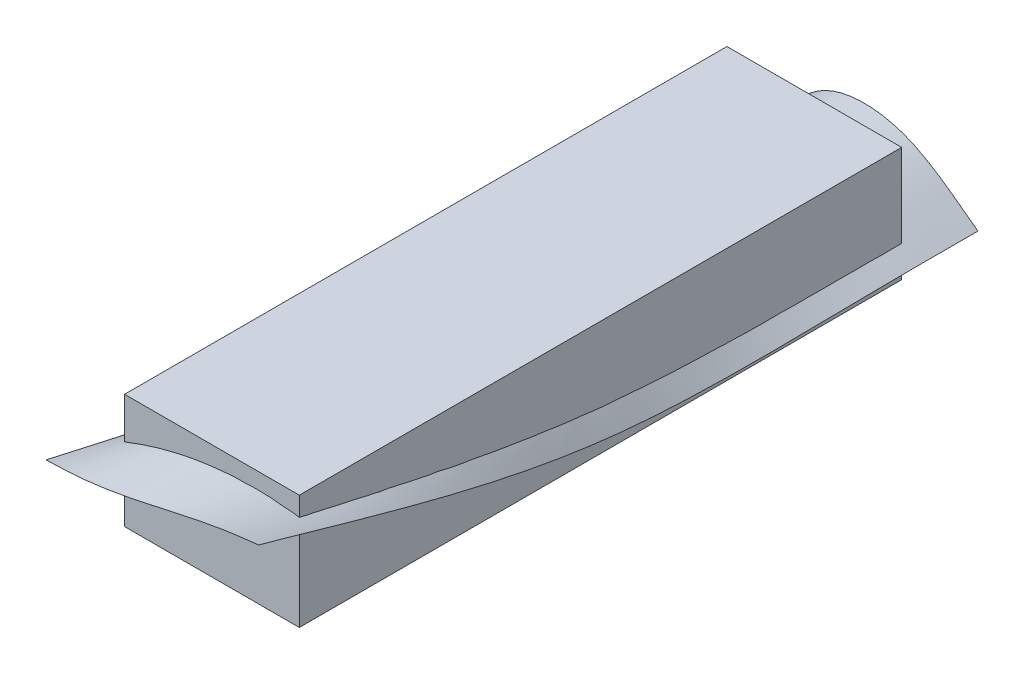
ISO-10303-21;
HEADER;
FILE_DESCRIPTION(('STEP AP214'),'2;1');
FILE_NAME('part.step','',(''),(''),'','','');
FILE_SCHEMA(('AUTOMOTIVE_DESIGN { 1 0 10303 214 1 1 1 1 }'));
ENDSEC;
DATA;
#1=APPLICATION_CONTEXT('core data for automotive mechanical design processes');
#2=APPLICATION_PROTOCOL_DEFINITION('international standard','automotive_design',2000,#1);
#3=PRODUCT_CONTEXT('',#1,'mechanical');
#4=PRODUCT('Part','Part','',(#3));
#5=PRODUCT_RELATED_PRODUCT_CATEGORY('part','',(#4));
#6=PRODUCT_DEFINITION_FORMATION('','',#4);
#7=PRODUCT_DEFINITION_CONTEXT('part definition',#1,'design');
#8=PRODUCT_DEFINITION('design','',#6,#7);
#9=PRODUCT_DEFINITION_SHAPE('','',#8);
#10=(LENGTH_UNIT() NAMED_UNIT(*) SI_UNIT(.MILLI.,.METRE.));
#11=(NAMED_UNIT(*) PLANE_ANGLE_UNIT() SI_UNIT($,.RADIAN.));
#12=(NAMED_UNIT(*) SI_UNIT($,.STERADIAN.) SOLID_ANGLE_UNIT());
#13=UNCERTAINTY_MEASURE_WITH_UNIT(LENGTH_MEASURE(1.E-05),#10,'distance_accuracy_value','');
#14=(GEOMETRIC_REPRESENTATION_CONTEXT(3) GLOBAL_UNCERTAINTY_ASSIGNED_CONTEXT((#13)) GLOBAL_UNIT_ASSIGNED_CONTEXT((#10,
#11,#12)) REPRESENTATION_CONTEXT('',''));
#15=CARTESIAN_POINT('',(0.,0.,0.));
#16=DIRECTION('',(0.,0.,1.));
#17=DIRECTION('',(1.,0.,0.));
#18=AXIS2_PLACEMENT_3D('',#15,#16,#17);
#19=CARTESIAN_POINT('',(101.832993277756,58.3264522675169,347.699662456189));
#20=CARTESIAN_POINT('',(101.574945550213,55.1696757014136,337.209774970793));
#21=CARTESIAN_POINT('',(101.31689782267,52.0128991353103,326.719887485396));
#22=CARTESIAN_POINT('',(101.058850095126,48.8561225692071,316.23));
#23=CARTESIAN_POINT('',(99.768943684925,33.0763039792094,263.794067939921));
#24=CARTESIAN_POINT('',(97.1884664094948,1.50853831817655,158.895193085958));
#25=CARTESIAN_POINT('',(100.105042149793,10.4608383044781,52.853665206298));
#26=CARTESIAN_POINT('',(100.105042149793,10.4608383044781,0.));
#27=CARTESIAN_POINT('',(100.105042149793,10.4608383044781,-10.5680118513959));
#28=CARTESIAN_POINT('',(100.105042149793,10.4608383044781,-21.1360237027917));
#29=CARTESIAN_POINT('',(100.105042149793,10.4608383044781,-31.7040355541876));
#30=CARTESIAN_POINT('',(98.4680638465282,57.9272116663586,347.701012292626));
#31=CARTESIAN_POINT('',(98.2960320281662,55.0403146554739,337.210674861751));
#32=CARTESIAN_POINT('',(98.1240002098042,52.1534176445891,326.720337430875));
#33=CARTESIAN_POINT('',(97.9519683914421,49.2665206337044,316.23));
#34=CARTESIAN_POINT('',(97.0920307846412,34.8357523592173,263.791818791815));
#35=CARTESIAN_POINT('',(95.371712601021,5.96678225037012,158.888444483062));
#36=CARTESIAN_POINT('',(97.3160964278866,12.5084829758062,52.8694208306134));
#37=CARTESIAN_POINT('',(97.3160964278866,12.5084829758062,0.));
#38=CARTESIAN_POINT('',(97.3160964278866,12.5084829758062,-10.571162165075));
#39=CARTESIAN_POINT('',(97.3160964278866,12.5084829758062,-21.14232433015));
#40=CARTESIAN_POINT('',(97.3160964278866,12.5084829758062,-31.713486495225));
#41=CARTESIAN_POINT('',(95.1031344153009,57.5279710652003,347.702362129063));
#42=CARTESIAN_POINT('',(95.0171185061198,54.9109536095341,337.211574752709));
#43=CARTESIAN_POINT('',(94.9311025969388,52.293936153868,326.720787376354));
#44=CARTESIAN_POINT('',(94.8450866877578,49.6769186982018,316.23));
#45=CARTESIAN_POINT('',(94.4151178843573,36.5952007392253,263.78956964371));
#46=CARTESIAN_POINT('',(93.5549587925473,10.4250261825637,158.881695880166));
#47=CARTESIAN_POINT('',(94.52715070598,14.5561276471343,52.8851764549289));
#48=CARTESIAN_POINT('',(94.52715070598,14.5561276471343,0.));
#49=CARTESIAN_POINT('',(94.52715070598,14.5561276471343,-10.5743124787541));
#50=CARTESIAN_POINT('',(94.52715070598,14.5561276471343,-21.1486249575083));
#51=CARTESIAN_POINT('',(94.52715070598,14.5561276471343,-31.7229374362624));
#52=CARTESIAN_POINT('',(91.7382049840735,57.128730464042,347.7037119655));
#53=CARTESIAN_POINT('',(91.7382049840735,54.7815925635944,337.212474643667));
#54=CARTESIAN_POINT('',(91.7382049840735,52.4344546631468,326.721237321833));
#55=CARTESIAN_POINT('',(91.7382049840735,50.0873167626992,316.23));
#56=CARTESIAN_POINT('',(91.7382049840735,38.3546491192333,263.787320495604));
#57=CARTESIAN_POINT('',(91.7382049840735,14.8832701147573,158.874947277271));
#58=CARTESIAN_POINT('',(91.7382049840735,16.6037723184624,52.9009320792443));
#59=CARTESIAN_POINT('',(91.7382049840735,16.6037723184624,0.));
#60=CARTESIAN_POINT('',(91.7382049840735,16.6037723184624,-10.5774627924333));
#61=CARTESIAN_POINT('',(91.7382049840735,16.6037723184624,-21.1549255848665));
#62=CARTESIAN_POINT('',(91.7382049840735,16.6037723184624,-31.7323883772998));
#63=CARTESIAN_POINT('',(78.9559110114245,55.6121427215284,347.708839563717));
#64=CARTESIAN_POINT('',(79.2826580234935,54.2901911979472,337.215893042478));
#65=CARTESIAN_POINT('',(79.6094050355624,52.9682396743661,326.722946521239));
#66=CARTESIAN_POINT('',(79.9361520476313,51.646288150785,316.23));
#67=CARTESIAN_POINT('',(81.5694664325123,45.0382324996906,263.77877669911));
#68=CARTESIAN_POINT('',(84.8369365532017,31.8187172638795,158.849311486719));
#69=CARTESIAN_POINT('',(81.1438894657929,24.3821215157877,52.9607826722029));
#70=CARTESIAN_POINT('',(81.1438894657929,24.3821215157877,0.));
#71=CARTESIAN_POINT('',(81.1438894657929,24.3821215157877,-10.5894298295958));
#72=CARTESIAN_POINT('',(81.1438894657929,24.3821215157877,-21.1788596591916));
#73=CARTESIAN_POINT('',(81.1438894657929,24.3821215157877,-31.7682894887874));
#74=CARTESIAN_POINT('',(60.7520702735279,51.7418820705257,347.716966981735));
#75=CARTESIAN_POINT('',(60.870386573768,51.9156769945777,337.221311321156));
#76=CARTESIAN_POINT('',(60.9887028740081,52.0894719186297,326.725655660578));
#77=CARTESIAN_POINT('',(61.1070191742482,52.2632668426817,316.23));
#78=CARTESIAN_POINT('',(61.6984483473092,53.132017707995,263.765234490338));
#79=CARTESIAN_POINT('',(62.8816113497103,54.8699669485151,158.808677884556));
#80=CARTESIAN_POINT('',(64.3515381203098,36.7110702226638,53.0556479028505));
#81=CARTESIAN_POINT('',(64.3515381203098,36.7110702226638,0.));
#82=CARTESIAN_POINT('',(64.3515381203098,36.7110702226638,-10.608397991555));
#83=CARTESIAN_POINT('',(64.3515381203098,36.7110702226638,-21.2167959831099));
#84=CARTESIAN_POINT('',(64.3515381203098,36.7110702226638,-31.8251939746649));
#85=CARTESIAN_POINT('',(38.5493627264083,46.6714477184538,347.722802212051));
#86=CARTESIAN_POINT('',(38.3085169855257,47.5891000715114,337.225201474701));
#87=CARTESIAN_POINT('',(38.067671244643,48.5067524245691,326.72760073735));
#88=CARTESIAN_POINT('',(37.8268255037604,49.4244047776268,316.23));
#89=CARTESIAN_POINT('',(36.6229068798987,54.0114850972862,263.755511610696));
#90=CARTESIAN_POINT('',(34.2144494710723,63.1880086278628,158.779504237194));
#91=CARTESIAN_POINT('',(36.6297787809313,39.7447426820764,53.1237581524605));
#92=CARTESIAN_POINT('',(36.6297787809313,39.7447426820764,0.));
#93=CARTESIAN_POINT('',(36.6297787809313,39.7447426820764,-10.6220165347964));
#94=CARTESIAN_POINT('',(36.6297787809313,39.7447426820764,-21.2440330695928));
#95=CARTESIAN_POINT('',(36.6297787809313,39.7447426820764,-31.8660496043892));
#96=CARTESIAN_POINT('',(20.1565258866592,43.3450592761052,347.720021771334));
#97=CARTESIAN_POINT('',(19.762699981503,43.9846808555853,337.223347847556));
#98=CARTESIAN_POINT('',(19.3688740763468,44.6243024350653,326.726673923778));
#99=CARTESIAN_POINT('',(18.9750481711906,45.2639240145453,316.23));
#100=CARTESIAN_POINT('',(17.0064256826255,48.4612084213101,263.760144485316));
#101=CARTESIAN_POINT('',(13.0681666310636,54.8574242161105,158.793405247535));
#102=CARTESIAN_POINT('',(15.6903172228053,34.0690692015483,53.0913041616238));
#103=CARTESIAN_POINT('',(15.6903172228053,34.0690692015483,0.));
#104=CARTESIAN_POINT('',(15.6903172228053,34.0690692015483,-10.6155274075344));
#105=CARTESIAN_POINT('',(15.6903172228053,34.0690692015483,-21.2310548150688));
#106=CARTESIAN_POINT('',(15.6903172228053,34.0690692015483,-31.8465822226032));
#107=CARTESIAN_POINT('',(8.03339286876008,41.8899088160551,347.71113464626));
#108=CARTESIAN_POINT('',(7.74267188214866,41.7124410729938,337.217423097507));
#109=CARTESIAN_POINT('',(7.45195089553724,41.5349733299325,326.723711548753));
#110=CARTESIAN_POINT('',(7.16122990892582,41.3575055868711,316.23));
#111=CARTESIAN_POINT('',(5.70799926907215,40.4703953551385,263.774952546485));
#112=CARTESIAN_POINT('',(2.80078940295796,38.6957179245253,158.837837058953));
#113=CARTESIAN_POINT('',(6.00028248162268,23.9885165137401,52.9875714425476));
#114=CARTESIAN_POINT('',(6.00028248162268,23.9885165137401,0.));
#115=CARTESIAN_POINT('',(6.00028248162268,23.9885165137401,-10.5947862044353));
#116=CARTESIAN_POINT('',(6.00028248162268,23.9885165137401,-21.1895724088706));
#117=CARTESIAN_POINT('',(6.00028248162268,23.9885165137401,-31.7843586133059));
#118=CARTESIAN_POINT('',(0.,41.5697081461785,347.70563154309));
#119=CARTESIAN_POINT('',(0.,40.5365082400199,337.21375436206));
#120=CARTESIAN_POINT('',(0.,39.5033083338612,326.72187718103));
#121=CARTESIAN_POINT('',(0.,38.4701084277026,316.23));
#122=CARTESIAN_POINT('',(0.,33.3054391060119,263.784122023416));
#123=CARTESIAN_POINT('',(0.,22.9734400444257,158.865350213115));
#124=CARTESIAN_POINT('',(0.,17.7464167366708,52.9233378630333));
#125=CARTESIAN_POINT('',(0.,17.7464167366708,0.));
#126=CARTESIAN_POINT('',(0.,17.7464167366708,-10.5819427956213));
#127=CARTESIAN_POINT('',(0.,17.7464167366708,-21.1638855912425));
#128=CARTESIAN_POINT('',(0.,17.7464167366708,-31.7458283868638));
#129=CARTESIAN_POINT('',(-3.26049078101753,41.4397491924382,347.70339801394));
#130=CARTESIAN_POINT('',(-3.14249666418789,40.0592356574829,337.212265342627));
#131=CARTESIAN_POINT('',(-3.02450254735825,38.6787221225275,326.721132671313));
#132=CARTESIAN_POINT('',(-2.90650843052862,37.2982085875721,316.23));
#133=CARTESIAN_POINT('',(-2.31668975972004,30.3974182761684,263.78784361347));
#134=CARTESIAN_POINT('',(-1.13674859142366,16.5922829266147,158.876516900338));
#135=CARTESIAN_POINT('',(-2.4353179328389,15.2129530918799,52.8972675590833));
#136=CARTESIAN_POINT('',(-2.4353179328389,15.2129530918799,0.));
#137=CARTESIAN_POINT('',(-2.4353179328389,15.2129530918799,-10.5767300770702));
#138=CARTESIAN_POINT('',(-2.4353179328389,15.2129530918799,-21.1534601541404));
#139=CARTESIAN_POINT('',(-2.4353179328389,15.2129530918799,-31.7301902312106));
#140=CARTESIAN_POINT('',(-6.52098156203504,41.309790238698,347.701164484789));
#141=CARTESIAN_POINT('',(-6.28499332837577,39.5819630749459,337.210776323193));
#142=CARTESIAN_POINT('',(-6.04900509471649,37.8541359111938,326.720388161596));
#143=CARTESIAN_POINT('',(-5.81301686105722,36.1263087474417,316.23));
#144=CARTESIAN_POINT('',(-4.63337951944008,27.4893974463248,263.791565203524));
#145=CARTESIAN_POINT('',(-2.27349718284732,10.2111258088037,158.887683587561));
#146=CARTESIAN_POINT('',(-4.8706358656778,12.6794894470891,52.8711972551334));
#147=CARTESIAN_POINT('',(-4.8706358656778,12.6794894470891,0.));
#148=CARTESIAN_POINT('',(-4.8706358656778,12.6794894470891,-10.5715173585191));
#149=CARTESIAN_POINT('',(-4.8706358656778,12.6794894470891,-21.1430347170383));
#150=CARTESIAN_POINT('',(-4.8706358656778,12.6794894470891,-31.7145520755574));
#151=CARTESIAN_POINT('',(-9.78147234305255,41.1798312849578,347.698930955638));
#152=CARTESIAN_POINT('',(-9.42748999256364,39.1046904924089,337.209287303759));
#153=CARTESIAN_POINT('',(-9.07350764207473,37.0295496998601,326.71964365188));
#154=CARTESIAN_POINT('',(-8.71952529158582,34.9544089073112,316.23));
#155=CARTESIAN_POINT('',(-6.95006927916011,24.5813766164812,263.795286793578));
#156=CARTESIAN_POINT('',(-3.41024577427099,3.82996869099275,158.898850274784));
#157=CARTESIAN_POINT('',(-7.3059537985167,10.1460258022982,52.8451269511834));
#158=CARTESIAN_POINT('',(-7.3059537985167,10.1460258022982,0.));
#159=CARTESIAN_POINT('',(-7.3059537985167,10.1460258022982,-10.5663046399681));
#160=CARTESIAN_POINT('',(-7.3059537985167,10.1460258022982,-21.1326092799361));
#161=CARTESIAN_POINT('',(-7.3059537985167,10.1460258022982,-31.6989139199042));
#162=B_SPLINE_SURFACE_WITH_KNOTS('',3,3,((#19,#20,#21,#22,#23,#24,#25,#26,#27,#28,#29),(#30,#31,
#32,#33,#34,#35,#36,#37,#38,#39,#40),(#41,#42,#43,#44,#45,#46,#47,#48,#49,#50,#51),(#52,#53,#54,
#55,#56,#57,#58,#59,#60,#61,#62),(#63,#64,#65,#66,#67,#68,#69,#70,#71,#72,#73),(#74,#75,#76,#77,
#78,#79,#80,#81,#82,#83,#84),(#85,#86,#87,#88,#89,#90,#91,#92,#93,#94,#95),(#96,#97,#98,#99,
#100,#101,#102,#103,#104,#105,#106),(#107,#108,#109,#110,#111,#112,#113,#114,#115,#116,#117),
(#118,#119,#120,#121,#122,#123,#124,#125,#126,#127,#128),(#129,#130,#131,#132,#133,#134,#135,
#136,#137,#138,#139),(#140,#141,#142,#143,#144,#145,#146,#147,#148,#149,#150),(#151,#152,#153,
#154,#155,#156,#157,#158,#159,#160,#161)),.UNSPECIFIED.,.F.,.F.,.F.,(4,3,1,1,1,3,4),(4,3,1,3,4),
(-0.1,0.,0.379868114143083,0.60210391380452,0.753613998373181,1.,1.1),(-0.1,0.,
0.499871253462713,1.,1.1),.UNSPECIFIED.);
#163=CARTESIAN_POINT('',(101.832993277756,58.3264522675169,347.699662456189));
#164=CARTESIAN_POINT('',(98.4680638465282,57.9272116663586,347.701012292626));
#165=CARTESIAN_POINT('',(95.1031344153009,57.5279710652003,347.702362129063));
#166=CARTESIAN_POINT('',(91.7382049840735,57.128730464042,347.7037119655));
#167=CARTESIAN_POINT('',(78.9559110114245,55.6121427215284,347.708839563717));
#168=CARTESIAN_POINT('',(60.7520702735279,51.7418820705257,347.716966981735));
#169=CARTESIAN_POINT('',(38.5493627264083,46.6714477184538,347.722802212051));
#170=CARTESIAN_POINT('',(20.1565258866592,43.3450592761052,347.720021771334));
#171=CARTESIAN_POINT('',(8.03339286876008,41.8899088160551,347.71113464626));
#172=CARTESIAN_POINT('',(0.,41.5697081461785,347.70563154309));
#173=CARTESIAN_POINT('',(-3.26049078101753,41.4397491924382,347.70339801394));
#174=CARTESIAN_POINT('',(-6.52098156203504,41.309790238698,347.701164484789));
#175=CARTESIAN_POINT('',(-9.78147234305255,41.1798312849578,347.698930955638));
#176=B_SPLINE_CURVE_WITH_KNOTS('',3,(#163,#164,#165,#166,#167,#168,#169,#170,#171,#172,#173,
#174,#175),.UNSPECIFIED.,.F.,.F.,(4,3,1,1,1,3,4),(-0.1,0.,0.379868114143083,0.60210391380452,
0.753613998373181,1.,1.1),.UNSPECIFIED.);
#177=CARTESIAN_POINT('',(101.832993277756,58.3264522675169,347.699662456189));
#178=VERTEX_POINT('',#177);
#179=CARTESIAN_POINT('',(-9.78147234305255,41.1798312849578,347.698930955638));
#180=VERTEX_POINT('',#179);
#181=EDGE_CURVE('E64',#178,#180,#176,.T.);
#182=CARTESIAN_POINT('',(-9.78147234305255,41.1798312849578,347.698930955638));
#183=CARTESIAN_POINT('',(-9.42748999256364,39.1046904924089,337.209287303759));
#184=CARTESIAN_POINT('',(-9.07350764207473,37.0295496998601,326.71964365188));
#185=CARTESIAN_POINT('',(-8.71952529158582,34.9544089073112,316.23));
#186=CARTESIAN_POINT('',(-6.95006927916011,24.5813766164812,263.795286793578));
#187=CARTESIAN_POINT('',(-3.41024577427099,3.82996869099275,158.898850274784));
#188=CARTESIAN_POINT('',(-7.3059537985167,10.1460258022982,52.8451269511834));
#189=CARTESIAN_POINT('',(-7.3059537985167,10.1460258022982,0.));
#190=CARTESIAN_POINT('',(-7.3059537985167,10.1460258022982,-10.5663046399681));
#191=CARTESIAN_POINT('',(-7.3059537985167,10.1460258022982,-21.1326092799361));
#192=CARTESIAN_POINT('',(-7.3059537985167,10.1460258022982,-31.6989139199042));
#193=B_SPLINE_CURVE_WITH_KNOTS('',3,(#182,#183,#184,#185,#186,#187,#188,#189,#190,#191,#192),
.UNSPECIFIED.,.F.,.F.,(4,3,1,3,4),(-0.1,0.,0.499871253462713,1.,1.1),.UNSPECIFIED.);
#194=CARTESIAN_POINT('',(-7.3059537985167,10.1460258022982,-31.6989139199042));
#195=VERTEX_POINT('',#194);
#196=EDGE_CURVE('E75',#180,#195,#193,.T.);
#197=CARTESIAN_POINT('',(100.105042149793,10.4608383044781,-31.7040355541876));
#198=CARTESIAN_POINT('',(97.3160964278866,12.5084829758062,-31.713486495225));
#199=CARTESIAN_POINT('',(94.52715070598,14.5561276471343,-31.7229374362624));
#200=CARTESIAN_POINT('',(91.7382049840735,16.6037723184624,-31.7323883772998));
#201=CARTESIAN_POINT('',(81.1438894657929,24.3821215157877,-31.7682894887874));
#202=CARTESIAN_POINT('',(64.3515381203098,36.7110702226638,-31.8251939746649));
#203=CARTESIAN_POINT('',(36.6297787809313,39.7447426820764,-31.8660496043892));
#204=CARTESIAN_POINT('',(15.6903172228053,34.0690692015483,-31.8465822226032));
#205=CARTESIAN_POINT('',(6.00028248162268,23.9885165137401,-31.7843586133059));
#206=CARTESIAN_POINT('',(0.,17.7464167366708,-31.7458283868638));
#207=CARTESIAN_POINT('',(-2.4353179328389,15.2129530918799,-31.7301902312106));
#208=CARTESIAN_POINT('',(-4.8706358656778,12.6794894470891,-31.7145520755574));
#209=CARTESIAN_POINT('',(-7.3059537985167,10.1460258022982,-31.6989139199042));
#210=B_SPLINE_CURVE_WITH_KNOTS('',3,(#197,#198,#199,#200,#201,#202,#203,#204,#205,#206,#207,
#208,#209),.UNSPECIFIED.,.F.,.F.,(4,3,1,1,1,3,4),(-0.1,0.,0.379868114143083,0.60210391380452,
0.753613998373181,1.,1.1),.UNSPECIFIED.);
#211=CARTESIAN_POINT('',(100.105042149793,10.4608383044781,-31.7040355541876));
#212=VERTEX_POINT('',#211);
#213=EDGE_CURVE('E60',#195,#212,#210,.F.);
#214=CARTESIAN_POINT('',(101.832993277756,58.3264522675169,347.699662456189));
#215=CARTESIAN_POINT('',(101.574945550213,55.1696757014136,337.209774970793));
#216=CARTESIAN_POINT('',(101.31689782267,52.0128991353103,326.719887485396));
#217=CARTESIAN_POINT('',(101.058850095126,48.8561225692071,316.23));
#218=CARTESIAN_POINT('',(99.768943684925,33.0763039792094,263.794067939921));
#219=CARTESIAN_POINT('',(97.1884664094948,1.50853831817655,158.895193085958));
#220=CARTESIAN_POINT('',(100.105042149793,10.4608383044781,52.853665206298));
#221=CARTESIAN_POINT('',(100.105042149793,10.4608383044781,0.));
#222=CARTESIAN_POINT('',(100.105042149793,10.4608383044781,-10.5680118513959));
#223=CARTESIAN_POINT('',(100.105042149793,10.4608383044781,-21.1360237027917));
#224=CARTESIAN_POINT('',(100.105042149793,10.4608383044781,-31.7040355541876));
#225=B_SPLINE_CURVE_WITH_KNOTS('',3,(#214,#215,#216,#217,#218,#219,#220,#221,#222,#223,#224),
.UNSPECIFIED.,.F.,.F.,(4,3,1,3,4),(-0.1,0.,0.499871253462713,1.,1.1),.UNSPECIFIED.);
#226=EDGE_CURVE('E13',#212,#178,#225,.F.);
#227=ORIENTED_EDGE('',*,*,#181,.T.);
#228=ORIENTED_EDGE('',*,*,#196,.T.);
#229=ORIENTED_EDGE('',*,*,#213,.T.);
#230=ORIENTED_EDGE('',*,*,#226,.T.);
#231=EDGE_LOOP('',(#227,#228,#229,#230));
#232=FACE_BOUND('',#231,.T.);
#233=ADVANCED_FACE('F51',(#232),#162,.T.);
#234=OPEN_SHELL('',(#233));
#235=SHELL_BASED_SURFACE_MODEL('B2',(#234));
#236=CARTESIAN_POINT('',(0.,0.,316.23));
#237=DIRECTION('',(1.,0.,0.));
#238=DIRECTION('',(0.,0.,-1.));
#239=AXIS2_PLACEMENT_3D('',#236,#237,#238);
#240=PLANE('',#239);
#241=DIRECTION('',(0.,-1.,0.));
#242=VECTOR('',#241,1.);
#243=CARTESIAN_POINT('',(0.,0.,0.));
#244=LINE('',#243,#242);
#245=CARTESIAN_POINT('',(0.,60.170985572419,0.));
#246=VERTEX_POINT('',#245);
#247=CARTESIAN_POINT('',(0.,0.,0.));
#248=VERTEX_POINT('',#247);
#249=EDGE_CURVE('E164',#246,#248,#244,.T.);
#250=ORIENTED_EDGE('',*,*,#249,.T.);
#251=DIRECTION('',(0.,0.,-1.));
#252=VECTOR('',#251,1.);
#253=CARTESIAN_POINT('',(0.,0.,316.23));
#254=LINE('',#253,#252);
#255=CARTESIAN_POINT('',(0.,0.,316.23));
#256=VERTEX_POINT('',#255);
#257=EDGE_CURVE('E49',#256,#248,#254,.T.);
#258=ORIENTED_EDGE('',*,*,#257,.F.);
#259=DIRECTION('',(0.,-1.,0.));
#260=VECTOR('',#259,1.);
#261=CARTESIAN_POINT('',(0.,0.,316.23));
#262=LINE('',#261,#260);
#263=CARTESIAN_POINT('',(0.,60.170985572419,316.23));
#264=VERTEX_POINT('',#263);
#265=EDGE_CURVE('E182',#264,#256,#262,.T.);
#266=ORIENTED_EDGE('',*,*,#265,.F.);
#267=DIRECTION('',(0.,0.,-1.));
#268=VECTOR('',#267,1.);
#269=CARTESIAN_POINT('',(0.,60.170985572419,316.23));
#270=LINE('',#269,#268);
#271=EDGE_CURVE('E176',#264,#246,#270,.T.);
#272=ORIENTED_EDGE('',*,*,#271,.T.);
#273=EDGE_LOOP('',(#250,#258,#266,#272));
#274=FACE_BOUND('',#273,.T.);
#275=ADVANCED_FACE('F120',(#274),#240,.F.);
#276=CARTESIAN_POINT('',(0.,0.,316.23));
#277=DIRECTION('',(0.,1.,0.));
#278=DIRECTION('',(0.,0.,1.));
#279=AXIS2_PLACEMENT_3D('',#276,#277,#278);
#280=PLANE('',#279);
#281=DIRECTION('',(1.,0.,0.));
#282=VECTOR('',#281,1.);
#283=CARTESIAN_POINT('',(0.,0.,0.));
#284=LINE('',#283,#282);
#285=CARTESIAN_POINT('',(91.7382049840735,0.,0.));
#286=VERTEX_POINT('',#285);
#287=EDGE_CURVE('E160',#248,#286,#284,.T.);
#288=ORIENTED_EDGE('',*,*,#287,.T.);
#289=DIRECTION('',(0.,0.,-1.));
#290=VECTOR('',#289,1.);
#291=CARTESIAN_POINT('',(91.7382049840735,0.,316.23));
#292=LINE('',#291,#290);
#293=CARTESIAN_POINT('',(91.7382049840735,0.,316.23));
#294=VERTEX_POINT('',#293);
#295=EDGE_CURVE('E127',#294,#286,#292,.T.);
#296=ORIENTED_EDGE('',*,*,#295,.F.);
#297=DIRECTION('',(1.,0.,0.));
#298=VECTOR('',#297,1.);
#299=CARTESIAN_POINT('',(0.,0.,316.23));
#300=LINE('',#299,#298);
#301=EDGE_CURVE('E172',#256,#294,#300,.T.);
#302=ORIENTED_EDGE('',*,*,#301,.F.);
#303=ORIENTED_EDGE('',*,*,#257,.T.);
#304=EDGE_LOOP('',(#288,#296,#302,#303));
#305=FACE_BOUND('',#304,.T.);
#306=ADVANCED_FACE('F171',(#305),#280,.F.);
#307=CARTESIAN_POINT('',(91.7382049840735,0.,316.23));
#308=DIRECTION('',(-1.,0.,0.));
#309=DIRECTION('',(0.,0.,1.));
#310=AXIS2_PLACEMENT_3D('',#307,#308,#309);
#311=PLANE('',#310);
#312=DIRECTION('',(0.,1.,0.));
#313=VECTOR('',#312,1.);
#314=CARTESIAN_POINT('',(91.7382049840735,0.,0.));
#315=LINE('',#314,#313);
#316=CARTESIAN_POINT('',(91.7382049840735,60.170985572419,0.));
#317=VERTEX_POINT('',#316);
#318=EDGE_CURVE('E165',#286,#317,#315,.T.);
#319=ORIENTED_EDGE('',*,*,#318,.T.);
#320=DIRECTION('',(0.,0.,-1.));
#321=VECTOR('',#320,1.);
#322=CARTESIAN_POINT('',(91.7382049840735,60.170985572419,316.23));
#323=LINE('',#322,#321);
#324=CARTESIAN_POINT('',(91.7382049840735,60.170985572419,316.23));
#325=VERTEX_POINT('',#324);
#326=EDGE_CURVE('E188',#325,#317,#323,.T.);
#327=ORIENTED_EDGE('',*,*,#326,.F.);
#328=DIRECTION('',(0.,1.,0.));
#329=VECTOR('',#328,1.);
#330=CARTESIAN_POINT('',(91.7382049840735,0.,316.23));
#331=LINE('',#330,#329);
#332=EDGE_CURVE('E139',#294,#325,#331,.T.);
#333=ORIENTED_EDGE('',*,*,#332,.F.);
#334=ORIENTED_EDGE('',*,*,#295,.T.);
#335=EDGE_LOOP('',(#319,#327,#333,#334));
#336=FACE_BOUND('',#335,.T.);
#337=ADVANCED_FACE('F191',(#336),#311,.F.);
#338=CARTESIAN_POINT('',(0.,60.170985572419,316.23));
#339=DIRECTION('',(0.,-1.,0.));
#340=DIRECTION('',(0.,0.,-1.));
#341=AXIS2_PLACEMENT_3D('',#338,#339,#340);
#342=PLANE('',#341);
#343=DIRECTION('',(-1.,0.,0.));
#344=VECTOR('',#343,1.);
#345=CARTESIAN_POINT('',(0.,60.170985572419,0.));
#346=LINE('',#345,#344);
#347=EDGE_CURVE('E180',#317,#246,#346,.T.);
#348=ORIENTED_EDGE('',*,*,#347,.T.);
#349=ORIENTED_EDGE('',*,*,#271,.F.);
#350=DIRECTION('',(-1.,0.,0.));
#351=VECTOR('',#350,1.);
#352=CARTESIAN_POINT('',(0.,60.170985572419,316.23));
#353=LINE('',#352,#351);
#354=EDGE_CURVE('E134',#325,#264,#353,.T.);
#355=ORIENTED_EDGE('',*,*,#354,.F.);
#356=ORIENTED_EDGE('',*,*,#326,.T.);
#357=EDGE_LOOP('',(#348,#349,#355,#356));
#358=FACE_BOUND('',#357,.T.);
#359=ADVANCED_FACE('F193',(#358),#342,.F.);
#360=CARTESIAN_POINT('',(0.,60.170985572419,316.23));
#361=DIRECTION('',(0.,0.,-1.));
#362=DIRECTION('',(-1.,0.,0.));
#363=AXIS2_PLACEMENT_3D('',#360,#361,#362);
#364=PLANE('',#363);
#365=ORIENTED_EDGE('',*,*,#265,.T.);
#366=ORIENTED_EDGE('',*,*,#301,.T.);
#367=ORIENTED_EDGE('',*,*,#332,.T.);
#368=ORIENTED_EDGE('',*,*,#354,.T.);
#369=EDGE_LOOP('',(#365,#366,#367,#368));
#370=FACE_BOUND('',#369,.T.);
#371=ADVANCED_FACE('F194',(#370),#364,.F.);
#372=CARTESIAN_POINT('',(0.,60.170985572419,0.));
#373=DIRECTION('',(0.,0.,-1.));
#374=DIRECTION('',(-1.,0.,0.));
#375=AXIS2_PLACEMENT_3D('',#372,#373,#374);
#376=PLANE('',#375);
#377=ORIENTED_EDGE('',*,*,#249,.F.);
#378=ORIENTED_EDGE('',*,*,#347,.F.);
#379=ORIENTED_EDGE('',*,*,#318,.F.);
#380=ORIENTED_EDGE('',*,*,#287,.F.);
#381=EDGE_LOOP('',(#377,#378,#379,#380));
#382=FACE_BOUND('',#381,.T.);
#383=ADVANCED_FACE('F161',(#382),#376,.T.);
#384=CLOSED_SHELL('',(#275,#306,#337,#359,#371,#383));
#385=MANIFOLD_SOLID_BREP('B7',#384);
#386=ADVANCED_BREP_SHAPE_REPRESENTATION('',(#18,#385),#14);
#387=MANIFOLD_SURFACE_SHAPE_REPRESENTATION('',(#18,#235),#14);
#388=SHAPE_REPRESENTATION('',(#18),#14);
#389=SHAPE_DEFINITION_REPRESENTATION(#9,#388);
#390=SHAPE_REPRESENTATION_RELATIONSHIP('','',#388,#386);
#391=SHAPE_REPRESENTATION_RELATIONSHIP('','',#388,#387);
ENDSEC;
END-ISO-10303-21;
